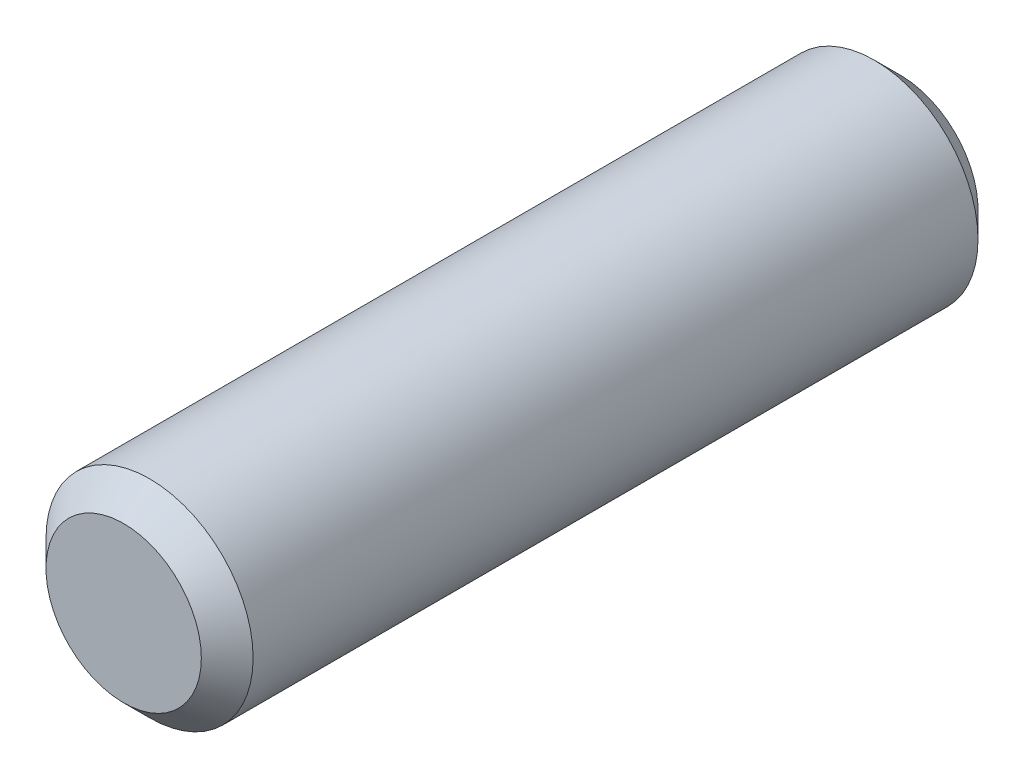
from build123d import *

# Parameters (mm, degrees)
ESQUISSE1_W     = 30
ESQUISSE1_H     = 4
CHANFREIN1_SIZE = 1


with BuildPart() as part:
    # Esquisse1 → R_volution1 (revolve)
    with BuildSketch(Plane(origin=(0, 0, 0), x_dir=(0, 0, -1), z_dir=(1, 0, 0)), mode=Mode.PRIVATE) as r_volution1_sk:
        with Locations((15, 2)):
            Rectangle(ESQUISSE1_W, ESQUISSE1_H)
    revolve(r_volution1_sk.sketch.rotate(Axis((0, 0, 0), (0, 0, 1)), 90), axis=Axis((0, 0, 0), (0, 0, 1)))

    # Chanfrein1
    chanfrein1_edges = [part.edges().sort_by_distance(p)[0] for p in [
        (4, 0, -30),
        (4, 0, 0),
    ]]
    chamfer(chanfrein1_edges, length=CHANFREIN1_SIZE)


solid = part.part
